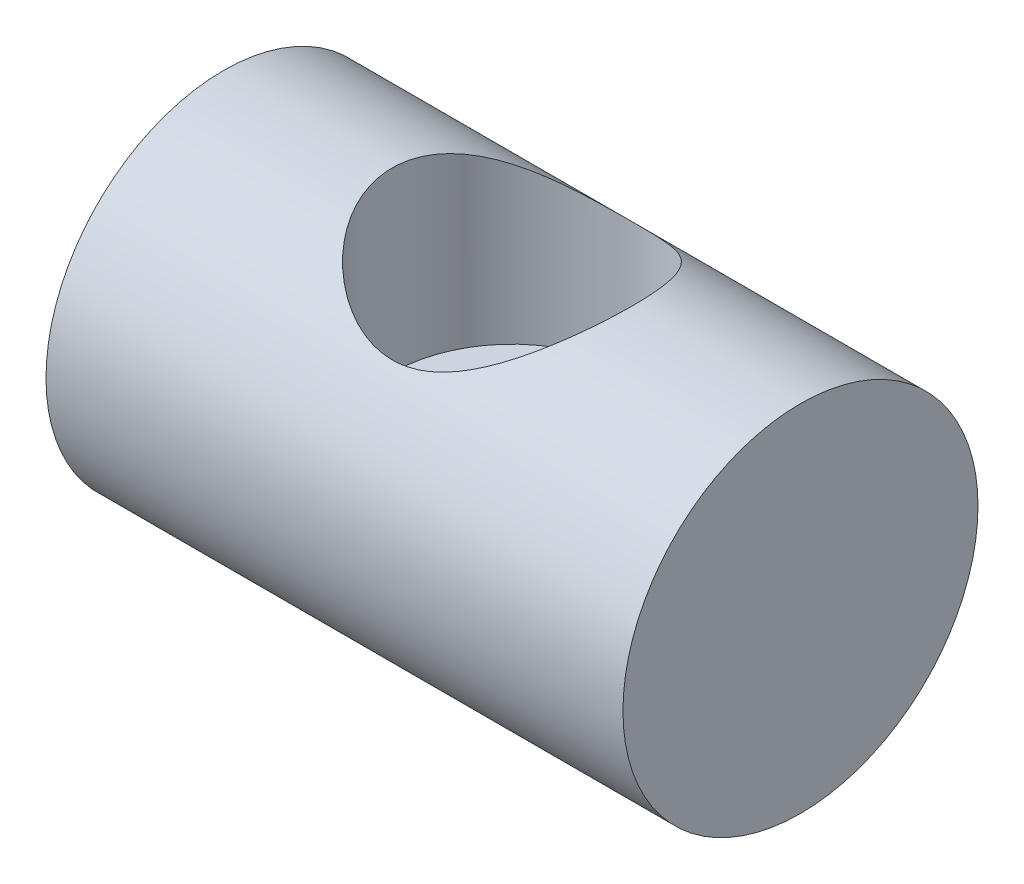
ISO-10303-21;
HEADER;
FILE_DESCRIPTION(('STEP AP214'),'2;1');
FILE_NAME('part.step','',(''),(''),'','','');
FILE_SCHEMA(('AUTOMOTIVE_DESIGN { 1 0 10303 214 1 1 1 1 }'));
ENDSEC;
DATA;
#1=APPLICATION_CONTEXT('core data for automotive mechanical design processes');
#2=APPLICATION_PROTOCOL_DEFINITION('international standard','automotive_design',2000,#1);
#3=PRODUCT_CONTEXT('',#1,'mechanical');
#4=PRODUCT('Part','Part','',(#3));
#5=PRODUCT_RELATED_PRODUCT_CATEGORY('part','',(#4));
#6=PRODUCT_DEFINITION_FORMATION('','',#4);
#7=PRODUCT_DEFINITION_CONTEXT('part definition',#1,'design');
#8=PRODUCT_DEFINITION('design','',#6,#7);
#9=PRODUCT_DEFINITION_SHAPE('','',#8);
#10=(LENGTH_UNIT() NAMED_UNIT(*) SI_UNIT(.MILLI.,.METRE.));
#11=(NAMED_UNIT(*) PLANE_ANGLE_UNIT() SI_UNIT($,.RADIAN.));
#12=(NAMED_UNIT(*) SI_UNIT($,.STERADIAN.) SOLID_ANGLE_UNIT());
#13=UNCERTAINTY_MEASURE_WITH_UNIT(LENGTH_MEASURE(1.E-05),#10,'distance_accuracy_value','');
#14=(GEOMETRIC_REPRESENTATION_CONTEXT(3) GLOBAL_UNCERTAINTY_ASSIGNED_CONTEXT((#13)) GLOBAL_UNIT_ASSIGNED_CONTEXT((#10,
#11,#12)) REPRESENTATION_CONTEXT('',''));
#15=CARTESIAN_POINT('',(0.,0.,0.));
#16=DIRECTION('',(0.,0.,1.));
#17=DIRECTION('',(1.,0.,0.));
#18=AXIS2_PLACEMENT_3D('',#15,#16,#17);
#19=CARTESIAN_POINT('',(16.25,0.,0.));
#20=DIRECTION('',(-1.,0.,0.));
#21=DIRECTION('',(0.,0.,1.));
#22=AXIS2_PLACEMENT_3D('',#19,#20,#21);
#23=CYLINDRICAL_SURFACE('',#22,10.);
#24=CARTESIAN_POINT('',(-4.25,-10.,0.));
#25=CARTESIAN_POINT('',(-4.2499991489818,-9.9999993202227,0.113677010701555));
#26=CARTESIAN_POINT('',(-4.24543274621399,-9.99805623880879,0.227390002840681));
#27=CARTESIAN_POINT('',(-4.22721176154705,-9.99033301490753,0.454001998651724));
#28=CARTESIAN_POINT('',(-4.21355159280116,-9.98455051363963,0.566900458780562));
#29=CARTESIAN_POINT('',(-4.17724551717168,-9.96928310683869,0.79123203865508));
#30=CARTESIAN_POINT('',(-4.15458164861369,-9.95979080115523,0.902661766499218));
#31=CARTESIAN_POINT('',(-4.10050993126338,-9.93735816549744,1.12303885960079));
#32=CARTESIAN_POINT('',(-4.06909850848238,-9.92441642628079,1.23198519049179));
#33=CARTESIAN_POINT('',(-3.96243751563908,-9.88099824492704,1.55313632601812));
#34=CARTESIAN_POINT('',(-3.87459168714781,-9.84585421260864,1.76068359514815));
#35=CARTESIAN_POINT('',(-3.66832631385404,-9.7665299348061,2.15778395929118));
#36=CARTESIAN_POINT('',(-3.54991534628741,-9.72235222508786,2.34734208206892));
#37=CARTESIAN_POINT('',(-3.27940969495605,-9.62679879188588,2.71333279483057));
#38=CARTESIAN_POINT('',(-3.12598555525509,-9.575181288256,2.8887188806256));
#39=CARTESIAN_POINT('',(-2.79249355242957,-9.47156108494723,3.2122322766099));
#40=CARTESIAN_POINT('',(-2.61241122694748,-9.41955819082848,3.36034469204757));
#41=CARTESIAN_POINT('',(-2.32044736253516,-9.34411580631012,3.56273269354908));
#42=CARTESIAN_POINT('',(-2.21665376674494,-9.31881195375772,3.62823008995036));
#43=CARTESIAN_POINT('',(-2.00341488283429,-9.27040479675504,3.75018577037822));
#44=CARTESIAN_POINT('',(-1.89397192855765,-9.24730059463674,3.80664774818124));
#45=CARTESIAN_POINT('',(-1.67010801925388,-9.20405886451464,3.91004416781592));
#46=CARTESIAN_POINT('',(-1.55568692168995,-9.18392142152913,3.95697833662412));
#47=CARTESIAN_POINT('',(-1.32271266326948,-9.14734105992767,4.04082235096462));
#48=CARTESIAN_POINT('',(-1.20416169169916,-9.13089621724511,4.07773741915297));
#49=CARTESIAN_POINT('',(-0.969695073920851,-9.10301776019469,4.13958476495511));
#50=CARTESIAN_POINT('',(-0.853935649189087,-9.09137781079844,4.16501622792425));
#51=CARTESIAN_POINT('',(-0.620400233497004,-9.07242317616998,4.20614460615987));
#52=CARTESIAN_POINT('',(-0.502625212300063,-9.06510646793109,4.22184607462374));
#53=CARTESIAN_POINT('',(-0.266010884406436,-9.05507017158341,4.24332956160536));
#54=CARTESIAN_POINT('',(-0.147171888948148,-9.05234928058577,4.24911439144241));
#55=CARTESIAN_POINT('',(0.0905821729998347,-9.05160615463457,4.25069723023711));
#56=CARTESIAN_POINT('',(0.209497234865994,-9.05358365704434,4.24649579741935));
#57=CARTESIAN_POINT('',(0.436829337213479,-9.06181439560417,4.22890119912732));
#58=CARTESIAN_POINT('',(0.545319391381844,-9.06770983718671,4.21627687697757));
#59=CARTESIAN_POINT('',(0.760760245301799,-9.08320870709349,4.18277997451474));
#60=CARTESIAN_POINT('',(0.867710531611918,-9.09281334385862,4.16190470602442));
#61=CARTESIAN_POINT('',(1.18511413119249,-9.12677022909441,4.08719274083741));
#62=CARTESIAN_POINT('',(1.39230581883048,-9.15627293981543,4.02125514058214));
#63=CARTESIAN_POINT('',(1.79696061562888,-9.22636545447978,3.857742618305));
#64=CARTESIAN_POINT('',(1.99411560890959,-9.26718166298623,3.75951307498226));
#65=CARTESIAN_POINT('',(2.36996125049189,-9.35525552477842,3.53465124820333));
#66=CARTESIAN_POINT('',(2.54864441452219,-9.40251577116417,3.40800751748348));
#67=CARTESIAN_POINT('',(2.89903533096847,-9.50322425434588,3.11680324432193));
#68=CARTESIAN_POINT('',(3.06873536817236,-9.55685048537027,2.94988263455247));
#69=CARTESIAN_POINT('',(3.37842561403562,-9.66074261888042,2.58944180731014));
#70=CARTESIAN_POINT('',(3.51840829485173,-9.71100766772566,2.39591487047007));
#71=CARTESIAN_POINT('',(3.76779403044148,-9.80408225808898,1.9814460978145));
#72=CARTESIAN_POINT('',(3.87634908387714,-9.84667505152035,1.75994172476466));
#73=CARTESIAN_POINT('',(4.05394494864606,-9.91792875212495,1.29954134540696));
#74=CARTESIAN_POINT('',(4.12300850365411,-9.94659767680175,1.06065543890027));
#75=CARTESIAN_POINT('',(4.21538691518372,-9.98525693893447,0.58901802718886));
#76=CARTESIAN_POINT('',(4.24139322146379,-9.99634415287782,0.356883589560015));
#77=CARTESIAN_POINT('',(4.25498217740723,-10.0021156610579,-0.108679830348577));
#78=CARTESIAN_POINT('',(4.24257643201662,-9.99680490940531,-0.342108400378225));
#79=CARTESIAN_POINT('',(4.1815920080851,-9.97108450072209,-0.790820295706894));
#80=CARTESIAN_POINT('',(4.1349309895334,-9.95147565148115,-1.00641547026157));
#81=CARTESIAN_POINT('',(4.00945950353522,-9.90000027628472,-1.42646420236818));
#82=CARTESIAN_POINT('',(3.93064501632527,-9.86813221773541,-1.63091636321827));
#83=CARTESIAN_POINT('',(3.74054215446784,-9.79394056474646,-2.03008552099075));
#84=CARTESIAN_POINT('',(3.62831746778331,-9.75132182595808,-2.22429988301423));
#85=CARTESIAN_POINT('',(3.37559392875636,-9.66013805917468,-2.59184226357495));
#86=CARTESIAN_POINT('',(3.23508307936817,-9.61157051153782,-2.76516136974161));
#87=CARTESIAN_POINT('',(2.91763571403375,-9.50925140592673,-3.09950633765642));
#88=CARTESIAN_POINT('',(2.73876994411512,-9.45538259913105,-3.25866563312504));
#89=CARTESIAN_POINT('',(2.35592156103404,-9.35168739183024,-3.54531249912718));
#90=CARTESIAN_POINT('',(2.15193238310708,-9.30186205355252,-3.67279176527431));
#91=CARTESIAN_POINT('',(1.82908281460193,-9.23426540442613,-3.83822490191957));
#92=CARTESIAN_POINT('',(1.71759949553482,-9.2127671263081,-3.88940372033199));
#93=CARTESIAN_POINT('',(1.49013144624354,-9.17308443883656,-3.98209310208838));
#94=CARTESIAN_POINT('',(1.37414873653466,-9.1548985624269,-4.02360794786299));
#95=CARTESIAN_POINT('',(1.1385656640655,-9.12251191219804,-4.09650697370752));
#96=CARTESIAN_POINT('',(1.0189671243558,-9.10830916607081,-4.12789616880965));
#97=CARTESIAN_POINT('',(0.777055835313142,-9.08442835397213,-4.18019034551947));
#98=CARTESIAN_POINT('',(0.654743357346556,-9.07474983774,-4.20109637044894));
#99=CARTESIAN_POINT('',(0.418284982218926,-9.06088620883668,-4.23090857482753));
#100=CARTESIAN_POINT('',(0.304264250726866,-9.05632506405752,-4.24063765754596));
#101=CARTESIAN_POINT('',(0.075678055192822,-9.05152837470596,-4.25086655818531));
#102=CARTESIAN_POINT('',(-0.0388875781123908,-9.05129427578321,-4.25136329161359));
#103=CARTESIAN_POINT('',(-0.267554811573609,-9.05516608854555,-4.24311097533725));
#104=CARTESIAN_POINT('',(-0.381656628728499,-9.05926965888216,-4.23436691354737));
#105=CARTESIAN_POINT('',(-0.608575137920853,-9.07165858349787,-4.20775610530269));
#106=CARTESIAN_POINT('',(-0.721391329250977,-9.07994551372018,-4.18988592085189));
#107=CARTESIAN_POINT('',(-1.0452481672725,-9.10964571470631,-4.12512147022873));
#108=CARTESIAN_POINT('',(-1.25361925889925,-9.1361655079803,-4.06657122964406));
#109=CARTESIAN_POINT('',(-1.65748186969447,-9.2002602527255,-3.91938458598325));
#110=CARTESIAN_POINT('',(-1.85296972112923,-9.23783833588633,-3.83073965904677));
#111=CARTESIAN_POINT('',(-2.23880499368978,-9.32267067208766,-3.61959902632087));
#112=CARTESIAN_POINT('',(-2.42809876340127,-9.37037755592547,-3.49535824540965));
#113=CARTESIAN_POINT('',(-2.78415428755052,-9.46887884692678,-3.21898596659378));
#114=CARTESIAN_POINT('',(-2.95090769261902,-9.5196743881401,-3.06684418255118));
#115=CARTESIAN_POINT('',(-3.27048069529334,-9.62335420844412,-2.72492668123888));
#116=CARTESIAN_POINT('',(-3.42123657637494,-9.67609784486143,-2.53315443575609));
#117=CARTESIAN_POINT('',(-3.62161084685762,-9.7493443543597,-2.22741156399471));
#118=CARTESIAN_POINT('',(-3.68414972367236,-9.77279852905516,-2.12238957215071));
#119=CARTESIAN_POINT('',(-3.80013621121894,-9.81711050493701,-1.90693593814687));
#120=CARTESIAN_POINT('',(-3.85358802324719,-9.83796950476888,-1.79650682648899));
#121=CARTESIAN_POINT('',(-3.95018922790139,-9.87621165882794,-1.57262713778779));
#122=CARTESIAN_POINT('',(-3.99347839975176,-9.8936413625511,-1.4592447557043));
#123=CARTESIAN_POINT('',(-4.0702972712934,-9.92489738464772,-1.22878834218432));
#124=CARTESIAN_POINT('',(-4.10383162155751,-9.9387254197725,-1.11171609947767));
#125=CARTESIAN_POINT('',(-4.16072006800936,-9.96235029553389,-0.875036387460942));
#126=CARTESIAN_POINT('',(-4.18409907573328,-9.97215699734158,-0.755435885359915));
#127=CARTESIAN_POINT('',(-4.22050491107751,-9.98748649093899,-0.514458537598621));
#128=CARTESIAN_POINT('',(-4.23353921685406,-9.99301237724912,-0.393083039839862));
#129=CARTESIAN_POINT('',(-4.24421778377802,-9.99754373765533,-0.226199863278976));
#130=CARTESIAN_POINT('',(-4.24638545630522,-9.99846427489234,-0.180994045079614));
#131=CARTESIAN_POINT('',(-4.24927673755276,-9.99969254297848,-0.0905273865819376));
#132=CARTESIAN_POINT('',(-4.25000033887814,-10.0000002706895,-0.045266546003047));
#133=CARTESIAN_POINT('',(-4.25,-10.,0.));
#134=B_SPLINE_CURVE_WITH_KNOTS('',3,(#24,#25,#26,#27,#28,#29,#30,#31,#32,#33,#34,#35,#36,#37,
#38,#39,#40,#41,#42,#43,#44,#45,#46,#47,#48,#49,#50,#51,#52,#53,#54,#55,#56,#57,#58,#59,#60,#61,
#62,#63,#64,#65,#66,#67,#68,#69,#70,#71,#72,#73,#74,#75,#76,#77,#78,#79,#80,#81,#82,#83,#84,#85,
#86,#87,#88,#89,#90,#91,#92,#93,#94,#95,#96,#97,#98,#99,#100,#101,#102,#103,#104,#105,#106,#107,
#108,#109,#110,#111,#112,#113,#114,#115,#116,#117,#118,#119,#120,#121,#122,#123,#124,#125,#126,
#127,#128,#129,#130,#131,#132,#133),.UNSPECIFIED.,.T.,.F.,(4,2,2,2,2,2,2,2,2,2,2,2,2,2,2,2,2,2,
2,2,2,2,2,2,2,2,2,2,2,2,2,2,2,2,2,2,2,2,2,2,2,2,2,2,2,2,2,2,2,2,2,2,2,2,4),(0.,
0.340984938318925,0.682179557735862,1.02405827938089,1.36607688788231,2.04701335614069,
2.72775894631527,3.4407382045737,4.15410568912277,4.52965078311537,4.90504195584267,
5.28044388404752,5.65564974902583,6.01244083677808,6.36906483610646,6.72558771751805,
7.08209067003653,7.40983435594,7.73768490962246,8.3928338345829,9.06217993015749,
9.73179617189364,10.4605154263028,11.1894190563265,11.9364680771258,12.6830864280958,
13.3809800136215,14.0786627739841,14.7400078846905,15.4014357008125,16.0834964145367,
16.7658470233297,17.4988311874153,18.2320072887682,18.605210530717,18.9782480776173,
19.3511005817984,19.7239159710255,20.0670475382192,20.4102937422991,20.7533547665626,
21.0965451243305,21.7475903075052,22.3988200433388,23.0900586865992,23.781552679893,
24.5263289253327,24.8993296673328,25.2721574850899,25.6395096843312,26.0066864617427,
26.3729573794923,26.7389632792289,26.874743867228,27.0105251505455),.UNSPECIFIED.);
#135=CARTESIAN_POINT('',(-4.25,-10.,0.));
#136=VERTEX_POINT('',#135);
#137=EDGE_CURVE('E10',#136,#136,#134,.T.);
#138=ORIENTED_EDGE('',*,*,#137,.T.);
#139=EDGE_LOOP('',(#138));
#140=FACE_BOUND('',#139,.T.);
#141=CARTESIAN_POINT('',(0.,7.37817728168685,6.75));
#142=CARTESIAN_POINT('',(-0.164109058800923,7.37817889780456,6.74999902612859));
#143=CARTESIAN_POINT('',(-0.328230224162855,7.38367790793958,6.74400235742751));
#144=CARTESIAN_POINT('',(-0.654891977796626,7.40538999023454,6.7201526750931));
#145=CARTESIAN_POINT('',(-0.817432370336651,7.42160437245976,6.70229821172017));
#146=CARTESIAN_POINT('',(-1.13972819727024,7.46397514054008,6.6550788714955));
#147=CARTESIAN_POINT('',(-1.29947968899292,7.49014457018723,6.62569889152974));
#148=CARTESIAN_POINT('',(-1.61487747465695,7.55124757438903,6.5559748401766));
#149=CARTESIAN_POINT('',(-1.77052159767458,7.58618568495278,6.51562509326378));
#150=CARTESIAN_POINT('',(-2.22679047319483,7.70131200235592,6.37994791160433));
#151=CARTESIAN_POINT('',(-2.52036588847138,7.79234150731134,6.26944157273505));
#152=CARTESIAN_POINT('',(-2.94291233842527,7.94234202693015,6.07666429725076));
#153=CARTESIAN_POINT('',(-3.08083941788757,7.99460673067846,6.00787180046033));
#154=CARTESIAN_POINT('',(-3.35073392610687,8.10244690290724,5.86162120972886));
#155=CARTESIAN_POINT('',(-3.48270119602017,8.15802245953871,5.78416288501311));
#156=CARTESIAN_POINT('',(-3.76108360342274,8.28041018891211,5.60785999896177));
#157=CARTESIAN_POINT('',(-3.90642258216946,8.34759525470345,5.50757773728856));
#158=CARTESIAN_POINT('',(-4.18844535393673,8.48323618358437,5.29626940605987));
#159=CARTESIAN_POINT('',(-4.32512860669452,8.5516921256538,5.18524266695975));
#160=CARTESIAN_POINT('',(-4.58960580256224,8.68844968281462,4.95268169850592));
#161=CARTESIAN_POINT('',(-4.71739085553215,8.75675107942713,4.83113722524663));
#162=CARTESIAN_POINT('',(-4.96349128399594,8.89174684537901,4.57792866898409));
#163=CARTESIAN_POINT('',(-5.08180466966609,8.95844087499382,4.44626247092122));
#164=CARTESIAN_POINT('',(-5.3254352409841,9.09870305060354,4.15257869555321));
#165=CARTESIAN_POINT('',(-5.4491258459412,9.17179473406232,3.98897577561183));
#166=CARTESIAN_POINT('',(-5.68206746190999,9.31207565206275,3.64951462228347));
#167=CARTESIAN_POINT('',(-5.79132479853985,9.37926746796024,3.47366180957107));
#168=CARTESIAN_POINT('',(-5.9940967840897,9.505810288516,3.11070134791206));
#169=CARTESIAN_POINT('',(-6.08763009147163,9.56517056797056,2.92360740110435));
#170=CARTESIAN_POINT('',(-6.25771823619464,9.67431033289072,2.53921006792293));
#171=CARTESIAN_POINT('',(-6.33427977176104,9.72409359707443,2.34191074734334));
#172=CARTESIAN_POINT('',(-6.45197824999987,9.80122896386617,1.98989000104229));
#173=CARTESIAN_POINT('',(-6.49717511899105,9.83106802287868,1.8370572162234));
#174=CARTESIAN_POINT('',(-6.57684195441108,9.88389894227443,1.52747507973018));
#175=CARTESIAN_POINT('',(-6.6113142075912,9.90689226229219,1.37072657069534));
#176=CARTESIAN_POINT('',(-6.66907888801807,9.94553430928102,1.05438357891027));
#177=CARTESIAN_POINT('',(-6.69237794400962,9.96118739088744,0.894790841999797));
#178=CARTESIAN_POINT('',(-6.72750724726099,9.98482270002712,0.573773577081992));
#179=CARTESIAN_POINT('',(-6.73933711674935,9.9928046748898,0.412348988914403));
#180=CARTESIAN_POINT('',(-6.75136520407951,10.0009205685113,0.088601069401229));
#181=CARTESIAN_POINT('',(-6.75154417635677,10.0010415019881,-0.0737233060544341));
#182=CARTESIAN_POINT('',(-6.74021957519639,9.9933999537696,-0.397775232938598));
#183=CARTESIAN_POINT('',(-6.7287160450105,9.98563750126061,-0.559502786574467));
#184=CARTESIAN_POINT('',(-6.69418891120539,9.96240444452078,-0.88119931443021));
#185=CARTESIAN_POINT('',(-6.67116249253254,9.94693195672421,-1.04116784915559));
#186=CARTESIAN_POINT('',(-6.61390871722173,9.9086243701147,-1.35818267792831));
#187=CARTESIAN_POINT('',(-6.579681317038,9.88578924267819,-1.51522896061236));
#188=CARTESIAN_POINT('',(-6.50117005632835,9.83371055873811,-1.82263497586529));
#189=CARTESIAN_POINT('',(-6.45707643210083,9.80458855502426,-1.97306400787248));
#190=CARTESIAN_POINT('',(-6.35900301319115,9.74028014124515,-2.26935366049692));
#191=CARTESIAN_POINT('',(-6.30501974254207,9.70509159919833,-2.41521265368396));
#192=CARTESIAN_POINT('',(-6.12905699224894,9.59138980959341,-2.84477915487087));
#193=CARTESIAN_POINT('',(-5.99300463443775,9.50469982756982,-3.12070706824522));
#194=CARTESIAN_POINT('',(-5.67068042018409,9.30464258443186,-3.67706270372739));
#195=CARTESIAN_POINT('',(-5.48047634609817,9.18936967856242,-3.95449137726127));
#196=CARTESIAN_POINT('',(-5.06392838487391,8.94718101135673,-4.47554593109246));
#197=CARTESIAN_POINT('',(-4.83754232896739,8.82025173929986,-4.71913174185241));
#198=CARTESIAN_POINT('',(-4.45354888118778,8.6172635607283,-5.07599837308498));
#199=CARTESIAN_POINT('',(-4.30650468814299,8.54200738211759,-5.20133350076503));
#200=CARTESIAN_POINT('',(-4.00182711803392,8.39252471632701,-5.4392314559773));
#201=CARTESIAN_POINT('',(-3.84419164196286,8.31829843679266,-5.55179173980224));
#202=CARTESIAN_POINT('',(-3.51886652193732,8.17305158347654,-5.76347999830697));
#203=CARTESIAN_POINT('',(-3.35118272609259,8.10202918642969,-5.86261567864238));
#204=CARTESIAN_POINT('',(-3.00615165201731,7.96550641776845,-6.04680494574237));
#205=CARTESIAN_POINT('',(-2.82880408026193,7.90000621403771,-6.13185810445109));
#206=CARTESIAN_POINT('',(-2.36932223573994,7.74488540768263,-6.3276792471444));
#207=CARTESIAN_POINT('',(-2.08094000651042,7.66059121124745,-6.42859572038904));
#208=CARTESIAN_POINT('',(-1.63566548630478,7.55592748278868,-6.55063551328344));
#209=CARTESIAN_POINT('',(-1.48517619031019,7.52467597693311,-6.58641922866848));
#210=CARTESIAN_POINT('',(-1.1806603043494,7.47054606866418,-6.64775304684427));
#211=CARTESIAN_POINT('',(-1.02663530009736,7.44766398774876,-6.67330764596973));
#212=CARTESIAN_POINT('',(-0.714799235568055,7.41109075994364,-6.71390294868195));
#213=CARTESIAN_POINT('',(-0.556967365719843,7.39747744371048,-6.72885466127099));
#214=CARTESIAN_POINT('',(-0.240087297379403,7.38038763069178,-6.74759531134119));
#215=CARTESIAN_POINT('',(-0.0810391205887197,7.37691095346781,-6.75138444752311));
#216=CARTESIAN_POINT('',(0.236825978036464,7.38026592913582,-6.74771665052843));
#217=CARTESIAN_POINT('',(0.395642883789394,7.38709826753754,-6.74025896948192));
#218=CARTESIAN_POINT('',(0.711604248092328,7.41073928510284,-6.71425714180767));
#219=CARTESIAN_POINT('',(0.86874873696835,7.4275477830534,-6.69571319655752));
#220=CARTESIAN_POINT('',(1.16317258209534,7.46803636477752,-6.65050677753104));
#221=CARTESIAN_POINT('',(1.30075446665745,7.49077087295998,-6.6249459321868));
#222=CARTESIAN_POINT('',(1.57289493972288,7.54278695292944,-6.56566205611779));
#223=CARTESIAN_POINT('',(1.70745263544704,7.5720704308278,-6.531936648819));
#224=CARTESIAN_POINT('',(2.1058581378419,7.6684944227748,-6.41903386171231));
#225=CARTESIAN_POINT('',(2.36443242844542,7.74420761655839,-6.32813084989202));
#226=CARTESIAN_POINT('',(2.79534506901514,7.8881049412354,-6.14713170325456));
#227=CARTESIAN_POINT('',(2.97183580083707,7.95262898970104,-6.06369508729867));
#228=CARTESIAN_POINT('',(3.31534140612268,8.08727740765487,-5.88291124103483));
#229=CARTESIAN_POINT('',(3.48235572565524,8.15740210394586,-5.78556319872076));
#230=CARTESIAN_POINT('',(3.8067197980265,8.30104927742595,-5.57750760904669));
#231=CARTESIAN_POINT('',(3.9640523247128,8.37457742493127,-5.46677723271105));
#232=CARTESIAN_POINT('',(4.26834776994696,8.52283099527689,-5.23264278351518));
#233=CARTESIAN_POINT('',(4.41531180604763,8.59755628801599,-5.10924008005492));
#234=CARTESIAN_POINT('',(4.70028972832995,8.7473042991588,-4.84846122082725));
#235=CARTESIAN_POINT('',(4.83815828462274,8.82231771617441,-4.71092080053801));
#236=CARTESIAN_POINT('',(5.10210463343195,8.96978240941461,-4.42369320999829));
#237=CARTESIAN_POINT('',(5.2281833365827,9.04223388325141,-4.27400697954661));
#238=CARTESIAN_POINT('',(5.46757195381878,9.18272650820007,-3.96315386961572));
#239=CARTESIAN_POINT('',(5.58089848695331,9.25077334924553,-3.80200239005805));
#240=CARTESIAN_POINT('',(5.79395765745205,9.38084902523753,-3.46866798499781));
#241=CARTESIAN_POINT('',(5.8936932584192,9.44287917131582,-3.29648747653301));
#242=CARTESIAN_POINT('',(6.06195371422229,9.54889083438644,-2.97358232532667));
#243=CARTESIAN_POINT('',(6.13287229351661,9.59411799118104,-2.82451015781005));
#244=CARTESIAN_POINT('',(6.26409718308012,9.6785271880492,-2.52012713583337));
#245=CARTESIAN_POINT('',(6.32440561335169,9.71771043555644,-2.36481753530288));
#246=CARTESIAN_POINT('',(6.43372784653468,9.7892106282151,-2.04880123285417));
#247=CARTESIAN_POINT('',(6.48274640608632,9.82153046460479,-1.88809683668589));
#248=CARTESIAN_POINT('',(6.56889803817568,9.8786071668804,-1.56220420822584));
#249=CARTESIAN_POINT('',(6.6060309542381,9.9033639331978,-1.39701591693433));
#250=CARTESIAN_POINT('',(6.66802816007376,9.94482604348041,-1.06252778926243));
#251=CARTESIAN_POINT('',(6.69283366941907,9.96149280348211,-0.893212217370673));
#252=CARTESIAN_POINT('',(6.72952662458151,9.98618264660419,-0.55255544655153));
#253=CARTESIAN_POINT('',(6.74141404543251,9.99420571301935,-0.381214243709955));
#254=CARTESIAN_POINT('',(6.75207667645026,10.0014011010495,-0.0379613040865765));
#255=CARTESIAN_POINT('',(6.75085367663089,10.0005746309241,0.13395035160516));
#256=CARTESIAN_POINT('',(6.73531917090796,9.99009464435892,0.476903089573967));
#257=CARTESIAN_POINT('',(6.72100833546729,9.98044158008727,0.647944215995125));
#258=CARTESIAN_POINT('',(6.6811557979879,9.95364985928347,0.974453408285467));
#259=CARTESIAN_POINT('',(6.65657919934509,9.93715516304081,1.13009388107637));
#260=CARTESIAN_POINT('',(6.59681597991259,9.89722115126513,1.43846918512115));
#261=CARTESIAN_POINT('',(6.56162577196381,9.87377948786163,1.59120301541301));
#262=CARTESIAN_POINT('',(6.48107580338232,9.82043449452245,1.89275100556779));
#263=CARTESIAN_POINT('',(6.43571905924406,9.79053308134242,2.04156631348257));
#264=CARTESIAN_POINT('',(6.33530943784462,9.72482417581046,2.33459994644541));
#265=CARTESIAN_POINT('',(6.28025283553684,9.68901441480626,2.47881648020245));
#266=CARTESIAN_POINT('',(6.15781505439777,9.61009247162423,2.76947207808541));
#267=CARTESIAN_POINT('',(6.08993514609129,9.56669375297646,2.91562346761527));
#268=CARTESIAN_POINT('',(5.94464358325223,9.47486829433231,3.20147673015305));
#269=CARTESIAN_POINT('',(5.86722846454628,9.4264397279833,3.34117623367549));
#270=CARTESIAN_POINT('',(5.62152230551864,9.27482068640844,3.74992843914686));
#271=CARTESIAN_POINT('',(5.43972742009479,9.16526853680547,4.00873583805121));
#272=CARTESIAN_POINT('',(5.12789566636,8.98466276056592,4.39320457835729));
#273=CARTESIAN_POINT('',(5.00824370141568,8.91679373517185,4.52908799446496));
#274=CARTESIAN_POINT('',(4.75890683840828,8.77917274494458,4.79039537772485));
#275=CARTESIAN_POINT('',(4.62922071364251,8.70942055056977,4.91581806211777));
#276=CARTESIAN_POINT('',(4.36025664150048,8.56948864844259,5.15588968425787));
#277=CARTESIAN_POINT('',(4.22097109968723,8.49930864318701,5.2705299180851));
#278=CARTESIAN_POINT('',(3.93328787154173,8.36016760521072,5.48856208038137));
#279=CARTESIAN_POINT('',(3.78489086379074,8.29120648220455,5.59195484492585));
#280=CARTESIAN_POINT('',(3.4881354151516,8.16014143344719,5.78139990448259));
#281=CARTESIAN_POINT('',(3.34026967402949,8.09787149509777,5.86810879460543));
#282=CARTESIAN_POINT('',(3.03699485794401,7.97756016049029,6.03065152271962));
#283=CARTESIAN_POINT('',(2.88158546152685,7.91951894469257,6.10648489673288));
#284=CARTESIAN_POINT('',(2.56381091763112,7.80950968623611,6.24655757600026));
#285=CARTESIAN_POINT('',(2.40145555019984,7.75753346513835,6.31081255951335));
#286=CARTESIAN_POINT('',(2.0701828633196,7.66146618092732,6.42710131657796));
#287=CARTESIAN_POINT('',(1.90126788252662,7.61737233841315,6.47913939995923));
#288=CARTESIAN_POINT('',(1.59065103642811,7.54648185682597,6.56147630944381));
#289=CARTESIAN_POINT('',(1.44993199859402,7.51798982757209,6.59402983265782));
#290=CARTESIAN_POINT('',(1.16550914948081,7.46835503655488,6.65019410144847));
#291=CARTESIAN_POINT('',(1.02180711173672,7.44720803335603,6.67381000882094));
#292=CARTESIAN_POINT('',(0.732301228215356,7.41303745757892,6.71174578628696));
#293=CARTESIAN_POINT('',(0.586498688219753,7.40000904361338,6.7260711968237));
#294=CARTESIAN_POINT('',(0.293800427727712,7.38257958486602,6.74519724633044));
#295=CARTESIAN_POINT('',(0.146905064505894,7.37817583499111,6.75000087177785));
#296=CARTESIAN_POINT('',(0.,7.37817728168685,6.75));
#297=B_SPLINE_CURVE_WITH_KNOTS('',3,(#141,#142,#143,#144,#145,#146,#147,#148,#149,#150,#151,
#152,#153,#154,#155,#156,#157,#158,#159,#160,#161,#162,#163,#164,#165,#166,#167,#168,#169,#170,
#171,#172,#173,#174,#175,#176,#177,#178,#179,#180,#181,#182,#183,#184,#185,#186,#187,#188,#189,
#190,#191,#192,#193,#194,#195,#196,#197,#198,#199,#200,#201,#202,#203,#204,#205,#206,#207,#208,
#209,#210,#211,#212,#213,#214,#215,#216,#217,#218,#219,#220,#221,#222,#223,#224,#225,#226,#227,
#228,#229,#230,#231,#232,#233,#234,#235,#236,#237,#238,#239,#240,#241,#242,#243,#244,#245,#246,
#247,#248,#249,#250,#251,#252,#253,#254,#255,#256,#257,#258,#259,#260,#261,#262,#263,#264,#265,
#266,#267,#268,#269,#270,#271,#272,#273,#274,#275,#276,#277,#278,#279,#280,#281,#282,#283,#284,
#285,#286,#287,#288,#289,#290,#291,#292,#293,#294,#295,#296),.UNSPECIFIED.,.T.,.F.,(4,2,2,2,2,2,
2,2,2,2,2,2,2,2,2,2,2,2,2,2,2,2,2,2,2,2,2,2,2,2,2,2,2,2,2,2,2,2,2,2,2,2,2,2,2,2,2,2,2,2,2,2,2,2,
2,2,2,2,2,2,2,2,2,2,2,2,2,2,2,2,2,2,2,2,2,2,2,4),(0.,0.492149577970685,0.984359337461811,
1.4772162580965,1.97032865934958,2.94560997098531,3.43361170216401,3.92162643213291,
4.48788934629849,5.05418757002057,5.62104369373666,6.18801859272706,6.84033955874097,
7.49237367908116,8.14362853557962,8.79462590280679,9.28055874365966,9.76638790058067,
10.251928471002,10.7374850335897,11.223843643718,11.7102004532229,12.1966761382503,
12.6831537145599,13.1609553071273,13.6389251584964,14.5941466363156,15.6570470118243,
16.7211953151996,17.3426787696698,17.9642857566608,18.5855344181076,19.2068019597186,
20.153344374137,20.6262996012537,21.0990467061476,21.5757161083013,22.0523770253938,
22.5290696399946,23.0057535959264,23.4306206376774,23.8556115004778,24.7056112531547,
25.3217423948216,25.9379095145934,26.5551430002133,27.1723098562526,27.7976992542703,
28.4230403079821,29.0475567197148,29.6719367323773,30.1849228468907,30.6978063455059,
31.2104733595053,31.7231471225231,32.2382425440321,32.7533389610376,33.2683650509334,
33.7833647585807,34.2581169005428,34.733029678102,35.2078017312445,35.6827565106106,
36.1828971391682,36.6832200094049,37.6835287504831,38.2631667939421,38.8428758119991,
39.4230488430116,40.0031787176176,40.5498056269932,41.0964558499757,41.6423602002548,
42.1880716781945,42.6292845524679,43.0702422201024,43.5109366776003,43.9514928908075),.UNSPECIFIED.);
#298=CARTESIAN_POINT('',(0.,7.37817728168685,6.75));
#299=VERTEX_POINT('',#298);
#300=EDGE_CURVE('E46',#299,#299,#297,.T.);
#301=ORIENTED_EDGE('',*,*,#300,.T.);
#302=EDGE_LOOP('',(#301));
#303=FACE_BOUND('',#302,.T.);
#304=CARTESIAN_POINT('',(16.25,0.,0.));
#305=DIRECTION('',(1.,0.,0.));
#306=DIRECTION('',(0.,0.,-1.));
#307=AXIS2_PLACEMENT_3D('',#304,#305,#306);
#308=CIRCLE('',#307,10.);
#309=CARTESIAN_POINT('',(16.25,0.,-10.));
#310=VERTEX_POINT('',#309);
#311=EDGE_CURVE('E50',#310,#310,#308,.T.);
#312=ORIENTED_EDGE('',*,*,#311,.F.);
#313=EDGE_LOOP('',(#312));
#314=FACE_BOUND('',#313,.T.);
#315=CARTESIAN_POINT('',(-16.25,0.,0.));
#316=DIRECTION('',(1.,0.,0.));
#317=DIRECTION('',(0.,0.,-1.));
#318=AXIS2_PLACEMENT_3D('',#315,#316,#317);
#319=CIRCLE('',#318,10.);
#320=CARTESIAN_POINT('',(-16.25,0.,-10.));
#321=VERTEX_POINT('',#320);
#322=EDGE_CURVE('E54',#321,#321,#319,.T.);
#323=ORIENTED_EDGE('',*,*,#322,.T.);
#324=EDGE_LOOP('',(#323));
#325=FACE_BOUND('',#324,.T.);
#326=ADVANCED_FACE('F36',(#140,#303,#314,#325),#23,.T.);
#327=CARTESIAN_POINT('',(16.25,0.,0.));
#328=DIRECTION('',(1.,0.,0.));
#329=DIRECTION('',(0.,0.,-1.));
#330=AXIS2_PLACEMENT_3D('',#327,#328,#329);
#331=PLANE('',#330);
#332=ORIENTED_EDGE('',*,*,#311,.T.);
#333=EDGE_LOOP('',(#332));
#334=FACE_BOUND('',#333,.T.);
#335=ADVANCED_FACE('F74',(#334),#331,.T.);
#336=CARTESIAN_POINT('',(-16.25,0.,0.));
#337=DIRECTION('',(1.,0.,0.));
#338=DIRECTION('',(0.,0.,-1.));
#339=AXIS2_PLACEMENT_3D('',#336,#337,#338);
#340=PLANE('',#339);
#341=ORIENTED_EDGE('',*,*,#322,.F.);
#342=EDGE_LOOP('',(#341));
#343=FACE_BOUND('',#342,.T.);
#344=ADVANCED_FACE('F72',(#343),#340,.F.);
#345=CARTESIAN_POINT('',(0.,10.,0.));
#346=DIRECTION('',(0.,1.,0.));
#347=DIRECTION('',(0.,0.,1.));
#348=AXIS2_PLACEMENT_3D('',#345,#346,#347);
#349=CYLINDRICAL_SURFACE('',#348,4.25);
#350=CARTESIAN_POINT('',(0.,0.,0.));
#351=DIRECTION('',(0.,1.,0.));
#352=DIRECTION('',(0.,0.,1.));
#353=AXIS2_PLACEMENT_3D('',#350,#351,#352);
#354=CIRCLE('',#353,4.25);
#355=CARTESIAN_POINT('',(0.,0.,4.25));
#356=VERTEX_POINT('',#355);
#357=EDGE_CURVE('E89',#356,#356,#354,.T.);
#358=ORIENTED_EDGE('',*,*,#357,.T.);
#359=EDGE_LOOP('',(#358));
#360=FACE_BOUND('',#359,.T.);
#361=ORIENTED_EDGE('',*,*,#137,.F.);
#362=EDGE_LOOP('',(#361));
#363=FACE_BOUND('',#362,.T.);
#364=ADVANCED_FACE('F65',(#360,#363),#349,.F.);
#365=CARTESIAN_POINT('',(0.,10.,0.));
#366=DIRECTION('',(0.,1.,0.));
#367=DIRECTION('',(0.,0.,1.));
#368=AXIS2_PLACEMENT_3D('',#365,#366,#367);
#369=CYLINDRICAL_SURFACE('',#368,6.75);
#370=CARTESIAN_POINT('',(0.,0.,0.));
#371=DIRECTION('',(0.,1.,0.));
#372=DIRECTION('',(0.,0.,1.));
#373=AXIS2_PLACEMENT_3D('',#370,#371,#372);
#374=CIRCLE('',#373,6.75);
#375=CARTESIAN_POINT('',(0.,0.,6.75));
#376=VERTEX_POINT('',#375);
#377=EDGE_CURVE('E91',#376,#376,#374,.T.);
#378=ORIENTED_EDGE('',*,*,#377,.F.);
#379=EDGE_LOOP('',(#378));
#380=FACE_BOUND('',#379,.T.);
#381=ORIENTED_EDGE('',*,*,#300,.F.);
#382=EDGE_LOOP('',(#381));
#383=FACE_BOUND('',#382,.T.);
#384=ADVANCED_FACE('F60',(#380,#383),#369,.F.);
#385=CARTESIAN_POINT('',(4.25,0.,0.));
#386=DIRECTION('',(0.,-1.,0.));
#387=DIRECTION('',(0.,0.,-1.));
#388=AXIS2_PLACEMENT_3D('',#385,#386,#387);
#389=PLANE('',#388);
#390=ORIENTED_EDGE('',*,*,#357,.F.);
#391=EDGE_LOOP('',(#390));
#392=FACE_BOUND('',#391,.T.);
#393=ORIENTED_EDGE('',*,*,#377,.T.);
#394=EDGE_LOOP('',(#393));
#395=FACE_BOUND('',#394,.T.);
#396=ADVANCED_FACE('F64',(#392,#395),#389,.F.);
#397=CLOSED_SHELL('',(#326,#335,#344,#364,#384,#396));
#398=MANIFOLD_SOLID_BREP('B2',#397);
#399=ADVANCED_BREP_SHAPE_REPRESENTATION('',(#18,#398),#14);
#400=SHAPE_DEFINITION_REPRESENTATION(#9,#399);
ENDSEC;
END-ISO-10303-21;
